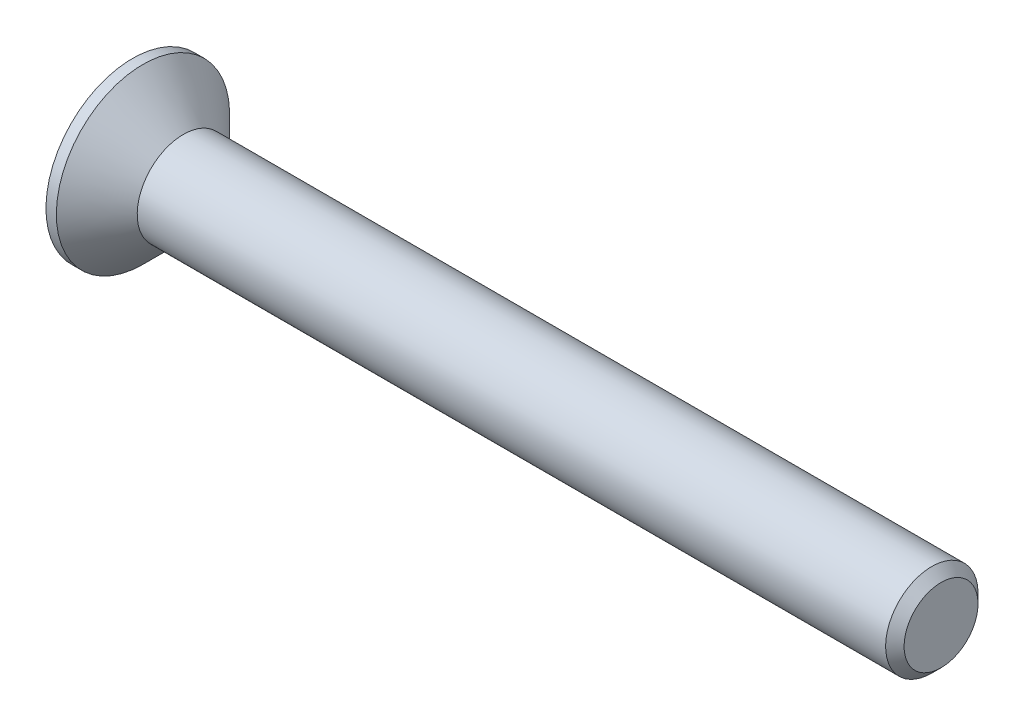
ISO-10303-21;
HEADER;
FILE_DESCRIPTION(('STEP AP214'),'2;1');
FILE_NAME('part.step','',(''),(''),'','','');
FILE_SCHEMA(('AUTOMOTIVE_DESIGN { 1 0 10303 214 1 1 1 1 }'));
ENDSEC;
DATA;
#1=APPLICATION_CONTEXT('core data for automotive mechanical design processes');
#2=APPLICATION_PROTOCOL_DEFINITION('international standard','automotive_design',2000,#1);
#3=PRODUCT_CONTEXT('',#1,'mechanical');
#4=PRODUCT('Part','Part','',(#3));
#5=PRODUCT_RELATED_PRODUCT_CATEGORY('part','',(#4));
#6=PRODUCT_DEFINITION_FORMATION('','',#4);
#7=PRODUCT_DEFINITION_CONTEXT('part definition',#1,'design');
#8=PRODUCT_DEFINITION('design','',#6,#7);
#9=PRODUCT_DEFINITION_SHAPE('','',#8);
#10=(LENGTH_UNIT() NAMED_UNIT(*) SI_UNIT(.MILLI.,.METRE.));
#11=(NAMED_UNIT(*) PLANE_ANGLE_UNIT() SI_UNIT($,.RADIAN.));
#12=(NAMED_UNIT(*) SI_UNIT($,.STERADIAN.) SOLID_ANGLE_UNIT());
#13=UNCERTAINTY_MEASURE_WITH_UNIT(LENGTH_MEASURE(1.E-05),#10,'distance_accuracy_value','');
#14=(GEOMETRIC_REPRESENTATION_CONTEXT(3) GLOBAL_UNCERTAINTY_ASSIGNED_CONTEXT((#13)) GLOBAL_UNIT_ASSIGNED_CONTEXT((#10,
#11,#12)) REPRESENTATION_CONTEXT('',''));
#15=CARTESIAN_POINT('',(0.,0.,0.));
#16=DIRECTION('',(0.,0.,1.));
#17=DIRECTION('',(1.,0.,0.));
#18=AXIS2_PLACEMENT_3D('',#15,#16,#17);
#19=CARTESIAN_POINT('',(0.,0.,0.));
#20=DIRECTION('',(-1.,0.,0.));
#21=DIRECTION('',(0.,-1.,0.));
#22=AXIS2_PLACEMENT_3D('',#19,#20,#21);
#23=CONICAL_SURFACE('',#22,2.,0.78539816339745);
#24=CARTESIAN_POINT('',(-1.74999999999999,0.,0.));
#25=DIRECTION('',(-1.,0.,0.));
#26=DIRECTION('',(0.,-1.,0.));
#27=AXIS2_PLACEMENT_3D('',#24,#25,#26);
#28=CIRCLE('',#27,3.75);
#29=CARTESIAN_POINT('',(-1.74999999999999,-3.75,0.));
#30=VERTEX_POINT('',#29);
#31=EDGE_CURVE('E189',#30,#30,#28,.T.);
#32=ORIENTED_EDGE('',*,*,#31,.F.);
#33=EDGE_LOOP('',(#32));
#34=FACE_BOUND('',#33,.T.);
#35=CARTESIAN_POINT('',(0.,0.,0.));
#36=DIRECTION('',(-1.,0.,0.));
#37=DIRECTION('',(0.,-1.,0.));
#38=AXIS2_PLACEMENT_3D('',#35,#36,#37);
#39=CIRCLE('',#38,2.);
#40=CARTESIAN_POINT('',(0.,-2.,0.));
#41=VERTEX_POINT('',#40);
#42=EDGE_CURVE('E212',#41,#41,#39,.T.);
#43=ORIENTED_EDGE('',*,*,#42,.T.);
#44=EDGE_LOOP('',(#43));
#45=FACE_BOUND('',#44,.T.);
#46=ADVANCED_FACE('F33',(#34,#45),#23,.T.);
#47=CARTESIAN_POINT('',(-2.2,0.,0.));
#48=DIRECTION('',(-1.,0.,0.));
#49=DIRECTION('',(0.,-1.,0.));
#50=AXIS2_PLACEMENT_3D('',#47,#48,#49);
#51=CYLINDRICAL_SURFACE('',#50,2.);
#52=CARTESIAN_POINT('',(32.4,0.,0.));
#53=DIRECTION('',(-1.,0.,0.));
#54=DIRECTION('',(0.,-1.,0.));
#55=AXIS2_PLACEMENT_3D('',#52,#53,#54);
#56=CIRCLE('',#55,2.);
#57=CARTESIAN_POINT('',(32.4,-2.,0.));
#58=VERTEX_POINT('',#57);
#59=EDGE_CURVE('E41',#58,#58,#56,.T.);
#60=ORIENTED_EDGE('',*,*,#59,.T.);
#61=EDGE_LOOP('',(#60));
#62=FACE_BOUND('',#61,.T.);
#63=ORIENTED_EDGE('',*,*,#42,.F.);
#64=EDGE_LOOP('',(#63));
#65=FACE_BOUND('',#64,.T.);
#66=ADVANCED_FACE('F217',(#62,#65),#51,.T.);
#67=CARTESIAN_POINT('',(32.8,0.,0.));
#68=DIRECTION('',(-1.,0.,0.));
#69=DIRECTION('',(0.,-1.,0.));
#70=AXIS2_PLACEMENT_3D('',#67,#68,#69);
#71=PLANE('',#70);
#72=CARTESIAN_POINT('',(32.8,0.,0.));
#73=DIRECTION('',(-1.,0.,0.));
#74=DIRECTION('',(0.,-1.,0.));
#75=AXIS2_PLACEMENT_3D('',#72,#73,#74);
#76=CIRCLE('',#75,1.59999999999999);
#77=CARTESIAN_POINT('',(32.8,-1.59999999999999,0.));
#78=VERTEX_POINT('',#77);
#79=EDGE_CURVE('E11',#78,#78,#76,.F.);
#80=ORIENTED_EDGE('',*,*,#79,.T.);
#81=EDGE_LOOP('',(#80));
#82=FACE_BOUND('',#81,.T.);
#83=ADVANCED_FACE('F239',(#82),#71,.F.);
#84=CARTESIAN_POINT('',(-2.2,3.75,0.));
#85=DIRECTION('',(1.,0.,0.));
#86=DIRECTION('',(0.,1.,0.));
#87=AXIS2_PLACEMENT_3D('',#84,#85,#86);
#88=PLANE('',#87);
#89=DIRECTION('',(0.,0.,-1.));
#90=VECTOR('',#89,1.);
#91=CARTESIAN_POINT('',(-2.2,0.55,-2.2));
#92=LINE('',#91,#90);
#93=CARTESIAN_POINT('',(-2.2,0.55,-0.55));
#94=VERTEX_POINT('',#93);
#95=CARTESIAN_POINT('',(-2.2,0.55,-2.2));
#96=VERTEX_POINT('',#95);
#97=EDGE_CURVE('E158',#94,#96,#92,.T.);
#98=ORIENTED_EDGE('',*,*,#97,.F.);
#99=DIRECTION('',(0.,-1.,0.));
#100=VECTOR('',#99,1.);
#101=CARTESIAN_POINT('',(-2.2,0.55,-0.55));
#102=LINE('',#101,#100);
#103=CARTESIAN_POINT('',(-2.2,2.2,-0.55));
#104=VERTEX_POINT('',#103);
#105=EDGE_CURVE('E48',#104,#94,#102,.T.);
#106=ORIENTED_EDGE('',*,*,#105,.F.);
#107=DIRECTION('',(0.,0.,-1.));
#108=VECTOR('',#107,1.);
#109=CARTESIAN_POINT('',(-2.2,2.2,-0.55));
#110=LINE('',#109,#108);
#111=CARTESIAN_POINT('',(-2.2,2.2,0.55));
#112=VERTEX_POINT('',#111);
#113=EDGE_CURVE('E185',#112,#104,#110,.T.);
#114=ORIENTED_EDGE('',*,*,#113,.F.);
#115=DIRECTION('',(0.,1.,0.));
#116=VECTOR('',#115,1.);
#117=CARTESIAN_POINT('',(-2.2,2.2,0.55));
#118=LINE('',#117,#116);
#119=CARTESIAN_POINT('',(-2.2,0.55,0.55));
#120=VERTEX_POINT('',#119);
#121=EDGE_CURVE('E183',#120,#112,#118,.T.);
#122=ORIENTED_EDGE('',*,*,#121,.F.);
#123=DIRECTION('',(0.,0.,-1.));
#124=VECTOR('',#123,1.);
#125=CARTESIAN_POINT('',(-2.2,0.55,0.55));
#126=LINE('',#125,#124);
#127=CARTESIAN_POINT('',(-2.2,0.55,2.2));
#128=VERTEX_POINT('',#127);
#129=EDGE_CURVE('E132',#128,#120,#126,.T.);
#130=ORIENTED_EDGE('',*,*,#129,.F.);
#131=DIRECTION('',(0.,1.,0.));
#132=VECTOR('',#131,1.);
#133=CARTESIAN_POINT('',(-2.2,0.55,2.2));
#134=LINE('',#133,#132);
#135=CARTESIAN_POINT('',(-2.2,-0.55,2.2));
#136=VERTEX_POINT('',#135);
#137=EDGE_CURVE('E179',#136,#128,#134,.T.);
#138=ORIENTED_EDGE('',*,*,#137,.F.);
#139=DIRECTION('',(0.,0.,1.));
#140=VECTOR('',#139,1.);
#141=CARTESIAN_POINT('',(-2.2,-0.55,2.2));
#142=LINE('',#141,#140);
#143=CARTESIAN_POINT('',(-2.2,-0.55,0.55));
#144=VERTEX_POINT('',#143);
#145=EDGE_CURVE('E176',#144,#136,#142,.T.);
#146=ORIENTED_EDGE('',*,*,#145,.F.);
#147=DIRECTION('',(0.,1.,0.));
#148=VECTOR('',#147,1.);
#149=CARTESIAN_POINT('',(-2.2,-0.55,0.55));
#150=LINE('',#149,#148);
#151=CARTESIAN_POINT('',(-2.2,-2.2,0.55));
#152=VERTEX_POINT('',#151);
#153=EDGE_CURVE('E173',#152,#144,#150,.T.);
#154=ORIENTED_EDGE('',*,*,#153,.F.);
#155=DIRECTION('',(0.,0.,1.));
#156=VECTOR('',#155,1.);
#157=CARTESIAN_POINT('',(-2.2,-2.2,0.55));
#158=LINE('',#157,#156);
#159=CARTESIAN_POINT('',(-2.2,-2.2,-0.55));
#160=VERTEX_POINT('',#159);
#161=EDGE_CURVE('E170',#160,#152,#158,.T.);
#162=ORIENTED_EDGE('',*,*,#161,.F.);
#163=DIRECTION('',(0.,-1.,0.));
#164=VECTOR('',#163,1.);
#165=CARTESIAN_POINT('',(-2.2,-2.2,-0.55));
#166=LINE('',#165,#164);
#167=CARTESIAN_POINT('',(-2.2,-0.55,-0.55));
#168=VERTEX_POINT('',#167);
#169=EDGE_CURVE('E167',#168,#160,#166,.T.);
#170=ORIENTED_EDGE('',*,*,#169,.F.);
#171=DIRECTION('',(0.,0.,1.));
#172=VECTOR('',#171,1.);
#173=CARTESIAN_POINT('',(-2.2,-0.55,-0.55));
#174=LINE('',#173,#172);
#175=CARTESIAN_POINT('',(-2.2,-0.55,-2.2));
#176=VERTEX_POINT('',#175);
#177=EDGE_CURVE('E164',#176,#168,#174,.T.);
#178=ORIENTED_EDGE('',*,*,#177,.F.);
#179=DIRECTION('',(0.,-1.,0.));
#180=VECTOR('',#179,1.);
#181=CARTESIAN_POINT('',(-2.2,-0.55,-2.2));
#182=LINE('',#181,#180);
#183=EDGE_CURVE('E161',#96,#176,#182,.T.);
#184=ORIENTED_EDGE('',*,*,#183,.F.);
#185=EDGE_LOOP('',(#98,#106,#114,#122,#130,#138,#146,#154,#162,#170,#178,#184));
#186=FACE_BOUND('',#185,.T.);
#187=CARTESIAN_POINT('',(-2.2,0.,0.));
#188=DIRECTION('',(-1.,0.,0.));
#189=DIRECTION('',(0.,-1.,0.));
#190=AXIS2_PLACEMENT_3D('',#187,#188,#189);
#191=CIRCLE('',#190,3.75);
#192=CARTESIAN_POINT('',(-2.2,-3.75,0.));
#193=VERTEX_POINT('',#192);
#194=EDGE_CURVE('E209',#193,#193,#191,.T.);
#195=ORIENTED_EDGE('',*,*,#194,.T.);
#196=EDGE_LOOP('',(#195));
#197=FACE_BOUND('',#196,.T.);
#198=ADVANCED_FACE('F230',(#186,#197),#88,.F.);
#199=CARTESIAN_POINT('',(-2.2,0.,0.));
#200=DIRECTION('',(-1.,0.,0.));
#201=DIRECTION('',(0.,-1.,0.));
#202=AXIS2_PLACEMENT_3D('',#199,#200,#201);
#203=CYLINDRICAL_SURFACE('',#202,3.75);
#204=ORIENTED_EDGE('',*,*,#194,.F.);
#205=EDGE_LOOP('',(#204));
#206=FACE_BOUND('',#205,.T.);
#207=ORIENTED_EDGE('',*,*,#31,.T.);
#208=EDGE_LOOP('',(#207));
#209=FACE_BOUND('',#208,.T.);
#210=ADVANCED_FACE('F222',(#206,#209),#203,.T.);
#211=CARTESIAN_POINT('',(32.4,0.,0.));
#212=DIRECTION('',(-1.,0.,0.));
#213=DIRECTION('',(0.,-1.,0.));
#214=AXIS2_PLACEMENT_3D('',#211,#212,#213);
#215=CONICAL_SURFACE('',#214,2.,0.785398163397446);
#216=ORIENTED_EDGE('',*,*,#79,.F.);
#217=EDGE_LOOP('',(#216));
#218=FACE_BOUND('',#217,.T.);
#219=ORIENTED_EDGE('',*,*,#59,.F.);
#220=EDGE_LOOP('',(#219));
#221=FACE_BOUND('',#220,.T.);
#222=ADVANCED_FACE('F35',(#218,#221),#215,.T.);
#223=CARTESIAN_POINT('',(-0.3,0.55,-0.55));
#224=DIRECTION('',(0.,0.,-1.));
#225=DIRECTION('',(-1.,0.,0.));
#226=AXIS2_PLACEMENT_3D('',#223,#224,#225);
#227=PLANE('',#226);
#228=ORIENTED_EDGE('',*,*,#105,.T.);
#229=DIRECTION('',(-1.,0.,0.));
#230=VECTOR('',#229,1.);
#231=CARTESIAN_POINT('',(-0.3,0.55,-0.55));
#232=LINE('',#231,#230);
#233=CARTESIAN_POINT('',(-0.3,0.55,-0.55));
#234=VERTEX_POINT('',#233);
#235=EDGE_CURVE('E96',#234,#94,#232,.T.);
#236=ORIENTED_EDGE('',*,*,#235,.F.);
#237=DIRECTION('',(0.,-1.,0.));
#238=VECTOR('',#237,1.);
#239=CARTESIAN_POINT('',(-0.3,0.55,-0.55));
#240=LINE('',#239,#238);
#241=CARTESIAN_POINT('',(-0.3,2.2,-0.55));
#242=VERTEX_POINT('',#241);
#243=EDGE_CURVE('E187',#242,#234,#240,.T.);
#244=ORIENTED_EDGE('',*,*,#243,.F.);
#245=DIRECTION('',(-1.,0.,0.));
#246=VECTOR('',#245,1.);
#247=CARTESIAN_POINT('',(-0.3,2.2,-0.55));
#248=LINE('',#247,#246);
#249=EDGE_CURVE('E56',#242,#104,#248,.T.);
#250=ORIENTED_EDGE('',*,*,#249,.T.);
#251=EDGE_LOOP('',(#228,#236,#244,#250));
#252=FACE_BOUND('',#251,.T.);
#253=ADVANCED_FACE('F221',(#252),#227,.F.);
#254=CARTESIAN_POINT('',(-0.3,2.2,-0.55));
#255=DIRECTION('',(0.,1.,0.));
#256=DIRECTION('',(-1.,0.,0.));
#257=AXIS2_PLACEMENT_3D('',#254,#255,#256);
#258=PLANE('',#257);
#259=ORIENTED_EDGE('',*,*,#113,.T.);
#260=ORIENTED_EDGE('',*,*,#249,.F.);
#261=DIRECTION('',(0.,0.,-1.));
#262=VECTOR('',#261,1.);
#263=CARTESIAN_POINT('',(-0.3,2.2,-0.55));
#264=LINE('',#263,#262);
#265=CARTESIAN_POINT('',(-0.3,2.2,0.55));
#266=VERTEX_POINT('',#265);
#267=EDGE_CURVE('E144',#266,#242,#264,.T.);
#268=ORIENTED_EDGE('',*,*,#267,.F.);
#269=DIRECTION('',(-1.,0.,0.));
#270=VECTOR('',#269,1.);
#271=CARTESIAN_POINT('',(-0.3,2.2,0.55));
#272=LINE('',#271,#270);
#273=EDGE_CURVE('E136',#266,#112,#272,.T.);
#274=ORIENTED_EDGE('',*,*,#273,.T.);
#275=EDGE_LOOP('',(#259,#260,#268,#274));
#276=FACE_BOUND('',#275,.T.);
#277=ADVANCED_FACE('F228',(#276),#258,.F.);
#278=CARTESIAN_POINT('',(-0.3,2.2,0.55));
#279=DIRECTION('',(0.,0.,1.));
#280=DIRECTION('',(1.,0.,0.));
#281=AXIS2_PLACEMENT_3D('',#278,#279,#280);
#282=PLANE('',#281);
#283=ORIENTED_EDGE('',*,*,#121,.T.);
#284=ORIENTED_EDGE('',*,*,#273,.F.);
#285=DIRECTION('',(0.,1.,0.));
#286=VECTOR('',#285,1.);
#287=CARTESIAN_POINT('',(-0.3,2.2,0.55));
#288=LINE('',#287,#286);
#289=CARTESIAN_POINT('',(-0.3,0.55,0.55));
#290=VERTEX_POINT('',#289);
#291=EDGE_CURVE('E140',#290,#266,#288,.T.);
#292=ORIENTED_EDGE('',*,*,#291,.F.);
#293=DIRECTION('',(-1.,0.,0.));
#294=VECTOR('',#293,1.);
#295=CARTESIAN_POINT('',(-0.3,0.55,0.55));
#296=LINE('',#295,#294);
#297=EDGE_CURVE('E125',#290,#120,#296,.T.);
#298=ORIENTED_EDGE('',*,*,#297,.T.);
#299=EDGE_LOOP('',(#283,#284,#292,#298));
#300=FACE_BOUND('',#299,.T.);
#301=ADVANCED_FACE('F141',(#300),#282,.F.);
#302=CARTESIAN_POINT('',(-0.3,0.55,0.55));
#303=DIRECTION('',(0.,1.,0.));
#304=DIRECTION('',(-1.,0.,0.));
#305=AXIS2_PLACEMENT_3D('',#302,#303,#304);
#306=PLANE('',#305);
#307=ORIENTED_EDGE('',*,*,#129,.T.);
#308=ORIENTED_EDGE('',*,*,#297,.F.);
#309=DIRECTION('',(0.,0.,-1.));
#310=VECTOR('',#309,1.);
#311=CARTESIAN_POINT('',(-0.3,0.55,0.55));
#312=LINE('',#311,#310);
#313=CARTESIAN_POINT('',(-0.3,0.55,2.2));
#314=VERTEX_POINT('',#313);
#315=EDGE_CURVE('E129',#314,#290,#312,.T.);
#316=ORIENTED_EDGE('',*,*,#315,.F.);
#317=DIRECTION('',(-1.,0.,0.));
#318=VECTOR('',#317,1.);
#319=CARTESIAN_POINT('',(-0.3,0.55,2.2));
#320=LINE('',#319,#318);
#321=EDGE_CURVE('E137',#314,#128,#320,.T.);
#322=ORIENTED_EDGE('',*,*,#321,.T.);
#323=EDGE_LOOP('',(#307,#308,#316,#322));
#324=FACE_BOUND('',#323,.T.);
#325=ADVANCED_FACE('F127',(#324),#306,.F.);
#326=CARTESIAN_POINT('',(-0.3,0.55,2.2));
#327=DIRECTION('',(0.,0.,1.));
#328=DIRECTION('',(1.,0.,0.));
#329=AXIS2_PLACEMENT_3D('',#326,#327,#328);
#330=PLANE('',#329);
#331=ORIENTED_EDGE('',*,*,#137,.T.);
#332=ORIENTED_EDGE('',*,*,#321,.F.);
#333=DIRECTION('',(0.,1.,0.));
#334=VECTOR('',#333,1.);
#335=CARTESIAN_POINT('',(-0.3,0.55,2.2));
#336=LINE('',#335,#334);
#337=CARTESIAN_POINT('',(-0.3,-0.55,2.2));
#338=VERTEX_POINT('',#337);
#339=EDGE_CURVE('E150',#338,#314,#336,.T.);
#340=ORIENTED_EDGE('',*,*,#339,.F.);
#341=DIRECTION('',(-1.,0.,0.));
#342=VECTOR('',#341,1.);
#343=CARTESIAN_POINT('',(-0.3,-0.55,2.2));
#344=LINE('',#343,#342);
#345=EDGE_CURVE('E192',#338,#136,#344,.T.);
#346=ORIENTED_EDGE('',*,*,#345,.T.);
#347=EDGE_LOOP('',(#331,#332,#340,#346));
#348=FACE_BOUND('',#347,.T.);
#349=ADVANCED_FACE('F277',(#348),#330,.F.);
#350=CARTESIAN_POINT('',(-0.3,-0.55,2.2));
#351=DIRECTION('',(0.,-1.,0.));
#352=DIRECTION('',(1.,0.,0.));
#353=AXIS2_PLACEMENT_3D('',#350,#351,#352);
#354=PLANE('',#353);
#355=ORIENTED_EDGE('',*,*,#145,.T.);
#356=ORIENTED_EDGE('',*,*,#345,.F.);
#357=DIRECTION('',(0.,0.,1.));
#358=VECTOR('',#357,1.);
#359=CARTESIAN_POINT('',(-0.3,-0.55,2.2));
#360=LINE('',#359,#358);
#361=CARTESIAN_POINT('',(-0.3,-0.55,0.55));
#362=VERTEX_POINT('',#361);
#363=EDGE_CURVE('E152',#362,#338,#360,.T.);
#364=ORIENTED_EDGE('',*,*,#363,.F.);
#365=DIRECTION('',(-1.,0.,0.));
#366=VECTOR('',#365,1.);
#367=CARTESIAN_POINT('',(-0.3,-0.55,0.55));
#368=LINE('',#367,#366);
#369=EDGE_CURVE('E194',#362,#144,#368,.T.);
#370=ORIENTED_EDGE('',*,*,#369,.T.);
#371=EDGE_LOOP('',(#355,#356,#364,#370));
#372=FACE_BOUND('',#371,.T.);
#373=ADVANCED_FACE('F273',(#372),#354,.F.);
#374=CARTESIAN_POINT('',(-0.3,-0.55,0.55));
#375=DIRECTION('',(0.,0.,1.));
#376=DIRECTION('',(1.,0.,0.));
#377=AXIS2_PLACEMENT_3D('',#374,#375,#376);
#378=PLANE('',#377);
#379=ORIENTED_EDGE('',*,*,#153,.T.);
#380=ORIENTED_EDGE('',*,*,#369,.F.);
#381=DIRECTION('',(0.,1.,0.));
#382=VECTOR('',#381,1.);
#383=CARTESIAN_POINT('',(-0.3,-0.55,0.55));
#384=LINE('',#383,#382);
#385=CARTESIAN_POINT('',(-0.3,-2.2,0.55));
#386=VERTEX_POINT('',#385);
#387=EDGE_CURVE('E422',#386,#362,#384,.T.);
#388=ORIENTED_EDGE('',*,*,#387,.F.);
#389=DIRECTION('',(-1.,0.,0.));
#390=VECTOR('',#389,1.);
#391=CARTESIAN_POINT('',(-0.3,-2.2,0.55));
#392=LINE('',#391,#390);
#393=EDGE_CURVE('E196',#386,#152,#392,.T.);
#394=ORIENTED_EDGE('',*,*,#393,.T.);
#395=EDGE_LOOP('',(#379,#380,#388,#394));
#396=FACE_BOUND('',#395,.T.);
#397=ADVANCED_FACE('F269',(#396),#378,.F.);
#398=CARTESIAN_POINT('',(-0.3,-2.2,0.55));
#399=DIRECTION('',(0.,-1.,0.));
#400=DIRECTION('',(1.,0.,0.));
#401=AXIS2_PLACEMENT_3D('',#398,#399,#400);
#402=PLANE('',#401);
#403=ORIENTED_EDGE('',*,*,#161,.T.);
#404=ORIENTED_EDGE('',*,*,#393,.F.);
#405=DIRECTION('',(0.,0.,1.));
#406=VECTOR('',#405,1.);
#407=CARTESIAN_POINT('',(-0.3,-2.2,0.55));
#408=LINE('',#407,#406);
#409=CARTESIAN_POINT('',(-0.3,-2.2,-0.55));
#410=VERTEX_POINT('',#409);
#411=EDGE_CURVE('E419',#410,#386,#408,.T.);
#412=ORIENTED_EDGE('',*,*,#411,.F.);
#413=DIRECTION('',(-1.,0.,0.));
#414=VECTOR('',#413,1.);
#415=CARTESIAN_POINT('',(-0.3,-2.2,-0.55));
#416=LINE('',#415,#414);
#417=EDGE_CURVE('E198',#410,#160,#416,.T.);
#418=ORIENTED_EDGE('',*,*,#417,.T.);
#419=EDGE_LOOP('',(#403,#404,#412,#418));
#420=FACE_BOUND('',#419,.T.);
#421=ADVANCED_FACE('F265',(#420),#402,.F.);
#422=CARTESIAN_POINT('',(-0.3,-2.2,-0.55));
#423=DIRECTION('',(0.,0.,-1.));
#424=DIRECTION('',(-1.,0.,0.));
#425=AXIS2_PLACEMENT_3D('',#422,#423,#424);
#426=PLANE('',#425);
#427=ORIENTED_EDGE('',*,*,#169,.T.);
#428=ORIENTED_EDGE('',*,*,#417,.F.);
#429=DIRECTION('',(0.,-1.,0.));
#430=VECTOR('',#429,1.);
#431=CARTESIAN_POINT('',(-0.3,-2.2,-0.55));
#432=LINE('',#431,#430);
#433=CARTESIAN_POINT('',(-0.3,-0.55,-0.55));
#434=VERTEX_POINT('',#433);
#435=EDGE_CURVE('E416',#434,#410,#432,.T.);
#436=ORIENTED_EDGE('',*,*,#435,.F.);
#437=DIRECTION('',(-1.,0.,0.));
#438=VECTOR('',#437,1.);
#439=CARTESIAN_POINT('',(-0.3,-0.55,-0.55));
#440=LINE('',#439,#438);
#441=EDGE_CURVE('E200',#434,#168,#440,.T.);
#442=ORIENTED_EDGE('',*,*,#441,.T.);
#443=EDGE_LOOP('',(#427,#428,#436,#442));
#444=FACE_BOUND('',#443,.T.);
#445=ADVANCED_FACE('F261',(#444),#426,.F.);
#446=CARTESIAN_POINT('',(-0.3,-0.55,-0.55));
#447=DIRECTION('',(0.,-1.,0.));
#448=DIRECTION('',(1.,0.,0.));
#449=AXIS2_PLACEMENT_3D('',#446,#447,#448);
#450=PLANE('',#449);
#451=ORIENTED_EDGE('',*,*,#177,.T.);
#452=ORIENTED_EDGE('',*,*,#441,.F.);
#453=DIRECTION('',(0.,0.,1.));
#454=VECTOR('',#453,1.);
#455=CARTESIAN_POINT('',(-0.3,-0.55,-0.55));
#456=LINE('',#455,#454);
#457=CARTESIAN_POINT('',(-0.3,-0.55,-2.2));
#458=VERTEX_POINT('',#457);
#459=EDGE_CURVE('E413',#458,#434,#456,.T.);
#460=ORIENTED_EDGE('',*,*,#459,.F.);
#461=DIRECTION('',(-1.,0.,0.));
#462=VECTOR('',#461,1.);
#463=CARTESIAN_POINT('',(-0.3,-0.55,-2.2));
#464=LINE('',#463,#462);
#465=EDGE_CURVE('E202',#458,#176,#464,.T.);
#466=ORIENTED_EDGE('',*,*,#465,.T.);
#467=EDGE_LOOP('',(#451,#452,#460,#466));
#468=FACE_BOUND('',#467,.T.);
#469=ADVANCED_FACE('F257',(#468),#450,.F.);
#470=CARTESIAN_POINT('',(-0.3,-0.55,-2.2));
#471=DIRECTION('',(0.,0.,-1.));
#472=DIRECTION('',(-1.,0.,0.));
#473=AXIS2_PLACEMENT_3D('',#470,#471,#472);
#474=PLANE('',#473);
#475=ORIENTED_EDGE('',*,*,#183,.T.);
#476=ORIENTED_EDGE('',*,*,#465,.F.);
#477=DIRECTION('',(0.,-1.,0.));
#478=VECTOR('',#477,1.);
#479=CARTESIAN_POINT('',(-0.3,-0.55,-2.2));
#480=LINE('',#479,#478);
#481=CARTESIAN_POINT('',(-0.3,0.55,-2.2));
#482=VERTEX_POINT('',#481);
#483=EDGE_CURVE('E408',#482,#458,#480,.T.);
#484=ORIENTED_EDGE('',*,*,#483,.F.);
#485=DIRECTION('',(-1.,0.,0.));
#486=VECTOR('',#485,1.);
#487=CARTESIAN_POINT('',(-0.3,0.55,-2.2));
#488=LINE('',#487,#486);
#489=EDGE_CURVE('E204',#482,#96,#488,.T.);
#490=ORIENTED_EDGE('',*,*,#489,.T.);
#491=EDGE_LOOP('',(#475,#476,#484,#490));
#492=FACE_BOUND('',#491,.T.);
#493=ADVANCED_FACE('F253',(#492),#474,.F.);
#494=CARTESIAN_POINT('',(-0.3,0.55,-2.2));
#495=DIRECTION('',(0.,1.,0.));
#496=DIRECTION('',(-1.,0.,0.));
#497=AXIS2_PLACEMENT_3D('',#494,#495,#496);
#498=PLANE('',#497);
#499=ORIENTED_EDGE('',*,*,#97,.T.);
#500=ORIENTED_EDGE('',*,*,#489,.F.);
#501=DIRECTION('',(0.,0.,-1.));
#502=VECTOR('',#501,1.);
#503=CARTESIAN_POINT('',(-0.3,0.55,-2.2));
#504=LINE('',#503,#502);
#505=EDGE_CURVE('E406',#234,#482,#504,.T.);
#506=ORIENTED_EDGE('',*,*,#505,.F.);
#507=ORIENTED_EDGE('',*,*,#235,.T.);
#508=EDGE_LOOP('',(#499,#500,#506,#507));
#509=FACE_BOUND('',#508,.T.);
#510=ADVANCED_FACE('F250',(#509),#498,.F.);
#511=CARTESIAN_POINT('',(-0.3,0.,0.));
#512=DIRECTION('',(1.,0.,0.));
#513=DIRECTION('',(0.,0.,-1.));
#514=AXIS2_PLACEMENT_3D('',#511,#512,#513);
#515=PLANE('',#514);
#516=ORIENTED_EDGE('',*,*,#243,.T.);
#517=ORIENTED_EDGE('',*,*,#505,.T.);
#518=ORIENTED_EDGE('',*,*,#483,.T.);
#519=ORIENTED_EDGE('',*,*,#459,.T.);
#520=ORIENTED_EDGE('',*,*,#435,.T.);
#521=ORIENTED_EDGE('',*,*,#411,.T.);
#522=ORIENTED_EDGE('',*,*,#387,.T.);
#523=ORIENTED_EDGE('',*,*,#363,.T.);
#524=ORIENTED_EDGE('',*,*,#339,.T.);
#525=ORIENTED_EDGE('',*,*,#315,.T.);
#526=ORIENTED_EDGE('',*,*,#291,.T.);
#527=ORIENTED_EDGE('',*,*,#267,.T.);
#528=EDGE_LOOP('',(#516,#517,#518,#519,#520,#521,#522,#523,#524,#525,#526,#527));
#529=FACE_BOUND('',#528,.T.);
#530=ADVANCED_FACE('F147',(#529),#515,.F.);
#531=CLOSED_SHELL('',(#46,#66,#83,#198,#210,#222,#253,#277,#301,#325,#349,#373,#397,#421,#445,
#469,#493,#510,#530));
#532=MANIFOLD_SOLID_BREP('B2',#531);
#533=ADVANCED_BREP_SHAPE_REPRESENTATION('',(#18,#532),#14);
#534=SHAPE_DEFINITION_REPRESENTATION(#9,#533);
ENDSEC;
END-ISO-10303-21;
